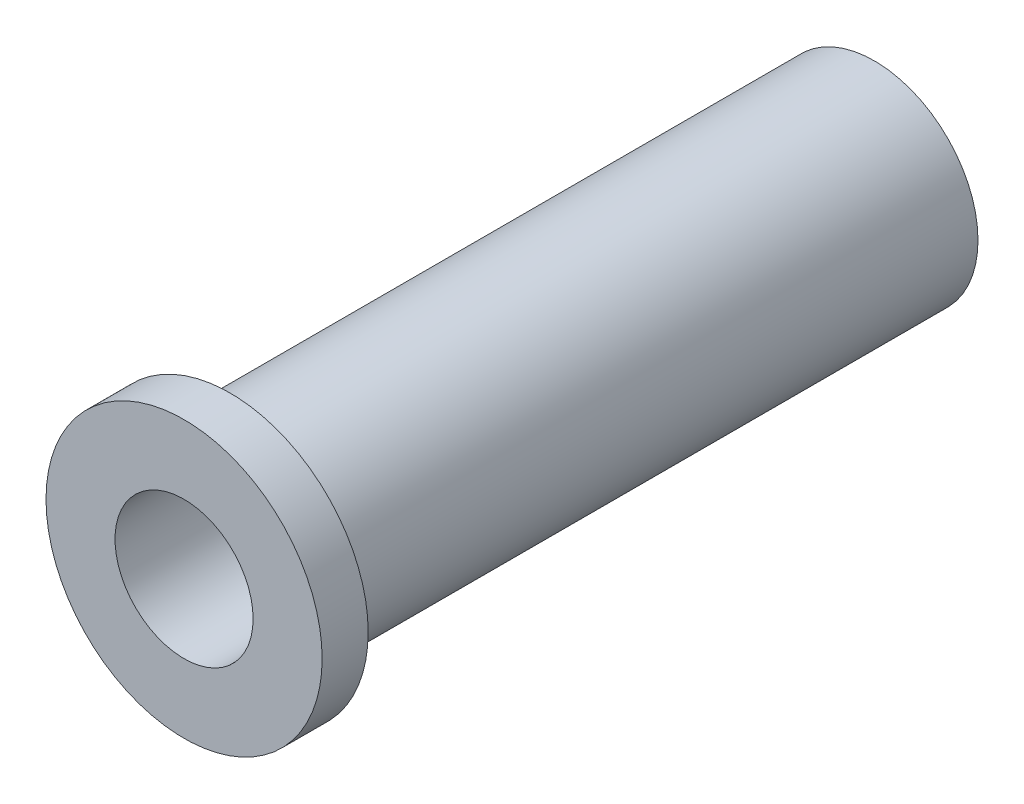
from build123d import *

# Parameters (mm, degrees)
ESQUISSE1_R             = 4.5
EXTRUSION1_DEPTH        = 28
ESQUISSE2_R             = 6
EXTRUSION2_DEPTH        = 2
ESQUISSE3_R             = 3
ENL_V_MAT_EXTRU_1_DEPTH = 32.176914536


with BuildPart() as part:
    # Esquisse1 → Extrusion1 (new body)
    with BuildSketch(Plane.XY):
        Circle(ESQUISSE1_R)
    extrude(amount=EXTRUSION1_DEPTH)

    # Esquisse2 → Extrusion2 (add)
    with BuildSketch(Plane.XY.offset(28)):
        Circle(ESQUISSE2_R)
    extrude(amount=EXTRUSION2_DEPTH)

    # Esquisse3 → Enl_v. mat.-Extru.1 (cut, through all)
    with BuildSketch(Plane.XY.offset(30)):
        Circle(ESQUISSE3_R)
    extrude(amount=-ENL_V_MAT_EXTRU_1_DEPTH, mode=Mode.SUBTRACT)


solid = part.part
